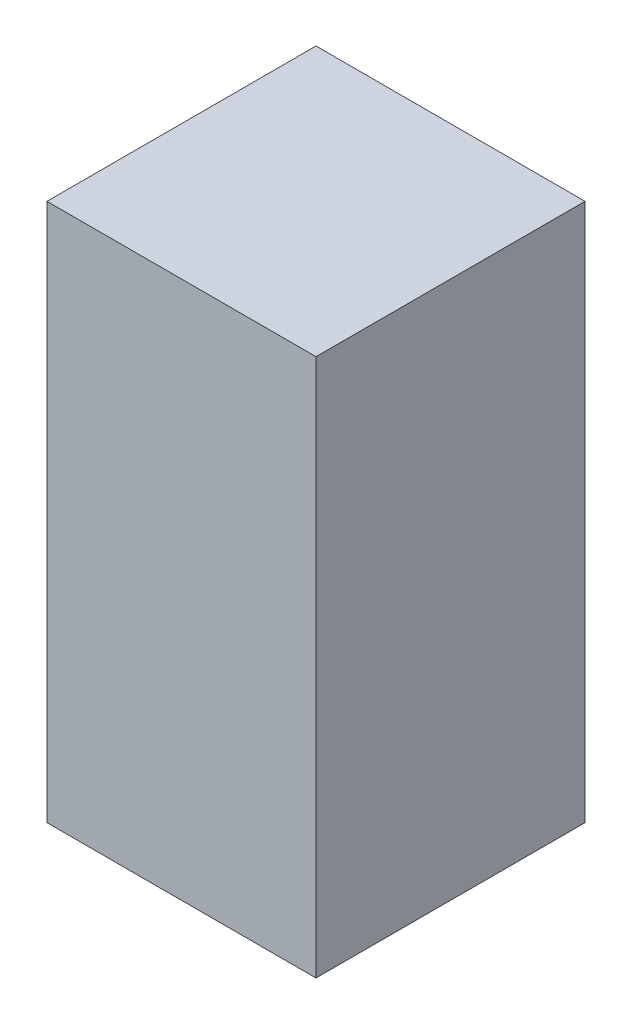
from build123d import *

# Parameters (mm, degrees)
SKETCH1_W           = 50.8
SKETCH1_H           = 50.8
BOSS_EXTRUDE1_DEPTH = 101.6


with BuildPart() as part:
    # Sketch1 → Boss-Extrude1 (new body)
    with BuildSketch(Plane(origin=(0, 0, 0), x_dir=(1, 0, 0), z_dir=(0, 1, 0))):
        Rectangle(SKETCH1_W, SKETCH1_H)
    extrude(amount=BOSS_EXTRUDE1_DEPTH)


solid = part.part
